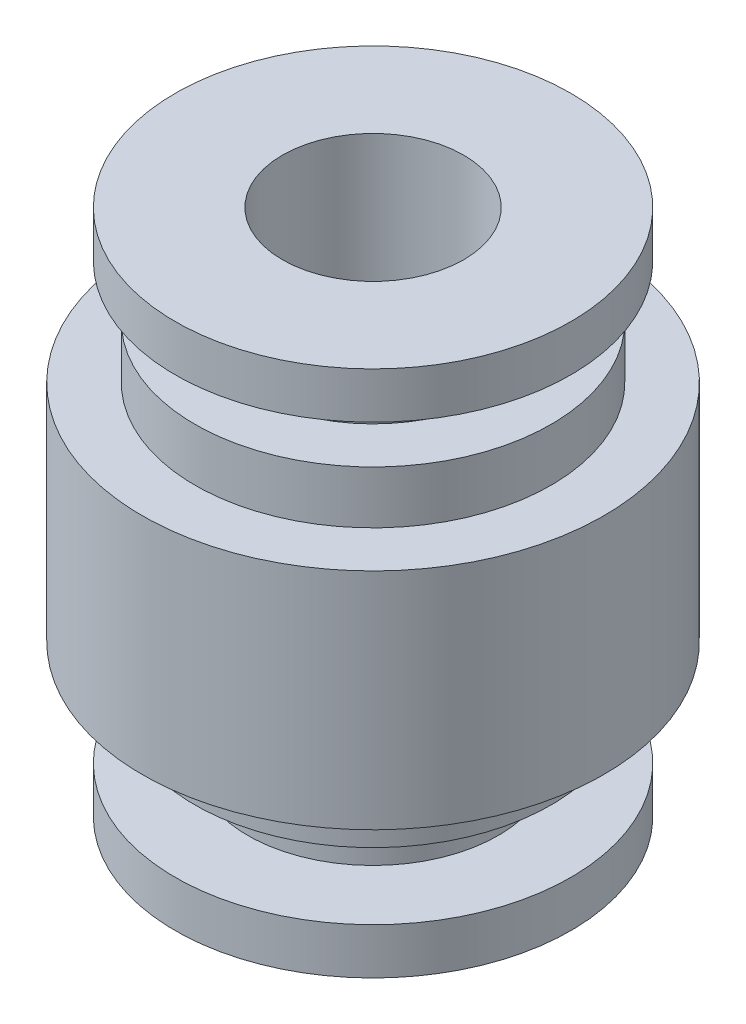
from build123d import *


with BuildPart() as part:
    # Sketch2 → Revolve1 (revolve)
    with BuildSketch(Plane.XY, mode=Mode.PRIVATE) as revolve1_sk:
        Polygon((3.4925, 0), (3.4925, 20.32), (7.62, 20.32), (7.62, 18.542), (4.826, 18.542), (4.826, 16.51), (6.858, 16.51), (6.858, 14.478), (8.89, 14.478), (8.89, 5.842), (6.858, 5.842), (6.858, 3.81), (4.826, 3.81), (4.826, 1.778), (7.62, 1.778), (7.62, 0), align=None)
    revolve(revolve1_sk.sketch.rotate(Axis((0, 0, 0), (0, 1, 0)), 90), axis=Axis((0, 0, 0), (0, 1, 0)))


solid = part.part
